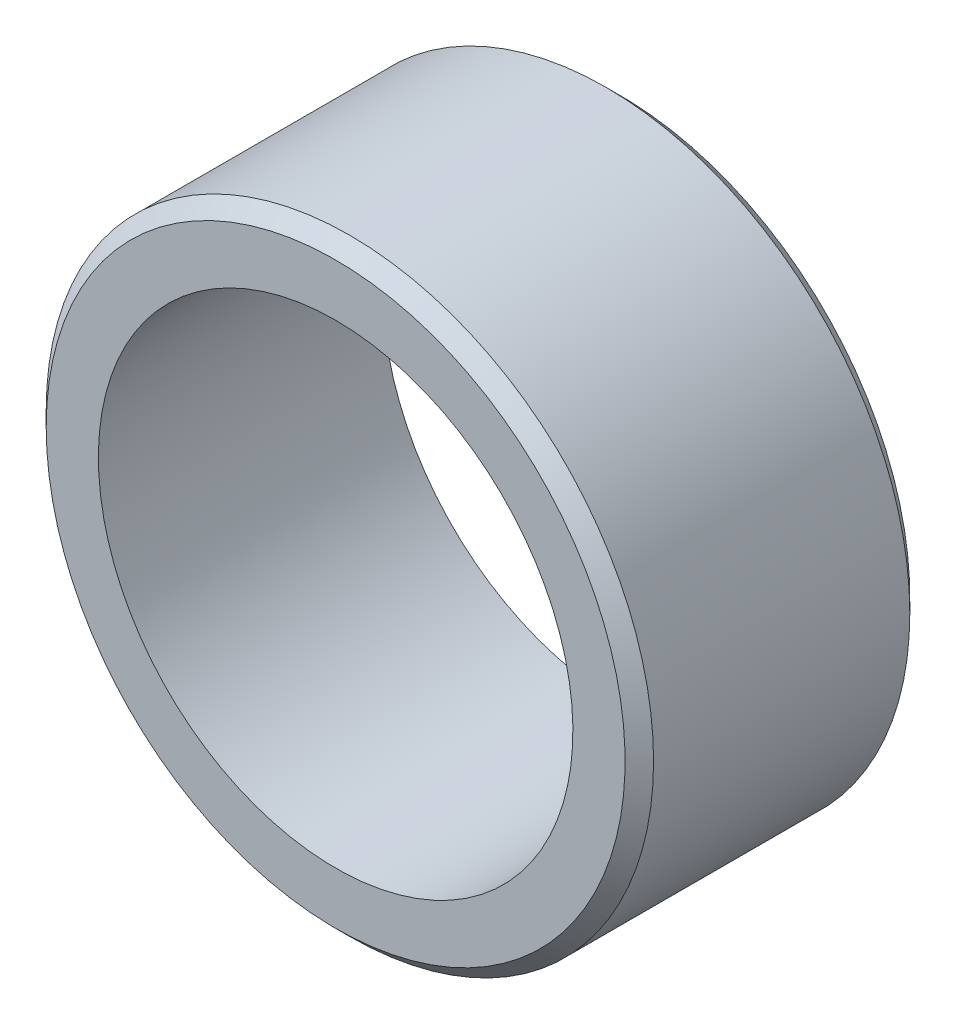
ISO-10303-21;
HEADER;
FILE_DESCRIPTION(('STEP AP214'),'2;1');
FILE_NAME('part.step','',(''),(''),'','','');
FILE_SCHEMA(('AUTOMOTIVE_DESIGN { 1 0 10303 214 1 1 1 1 }'));
ENDSEC;
DATA;
#1=APPLICATION_CONTEXT('core data for automotive mechanical design processes');
#2=APPLICATION_PROTOCOL_DEFINITION('international standard','automotive_design',2000,#1);
#3=PRODUCT_CONTEXT('',#1,'mechanical');
#4=PRODUCT('Part','Part','',(#3));
#5=PRODUCT_RELATED_PRODUCT_CATEGORY('part','',(#4));
#6=PRODUCT_DEFINITION_FORMATION('','',#4);
#7=PRODUCT_DEFINITION_CONTEXT('part definition',#1,'design');
#8=PRODUCT_DEFINITION('design','',#6,#7);
#9=PRODUCT_DEFINITION_SHAPE('','',#8);
#10=(LENGTH_UNIT() NAMED_UNIT(*) SI_UNIT(.MILLI.,.METRE.));
#11=(NAMED_UNIT(*) PLANE_ANGLE_UNIT() SI_UNIT($,.RADIAN.));
#12=(NAMED_UNIT(*) SI_UNIT($,.STERADIAN.) SOLID_ANGLE_UNIT());
#13=UNCERTAINTY_MEASURE_WITH_UNIT(LENGTH_MEASURE(1.E-05),#10,'distance_accuracy_value','');
#14=(GEOMETRIC_REPRESENTATION_CONTEXT(3) GLOBAL_UNCERTAINTY_ASSIGNED_CONTEXT((#13)) GLOBAL_UNIT_ASSIGNED_CONTEXT((#10,
#11,#12)) REPRESENTATION_CONTEXT('',''));
#15=CARTESIAN_POINT('',(0.,0.,0.));
#16=DIRECTION('',(0.,0.,1.));
#17=DIRECTION('',(1.,0.,0.));
#18=AXIS2_PLACEMENT_3D('',#15,#16,#17);
#19=CARTESIAN_POINT('',(0.,0.,7.5000000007));
#20=DIRECTION('',(0.,0.,-1.));
#21=DIRECTION('',(0.,1.,0.));
#22=AXIS2_PLACEMENT_3D('',#19,#20,#21);
#23=CYLINDRICAL_SURFACE('',#22,12.5000000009);
#24=CARTESIAN_POINT('',(0.,0.,0.));
#25=DIRECTION('',(0.,0.,-1.));
#26=DIRECTION('',(0.,1.,0.));
#27=AXIS2_PLACEMENT_3D('',#24,#25,#26);
#28=CIRCLE('',#27,12.5000000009);
#29=CARTESIAN_POINT('',(0.,12.5000000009,0.));
#30=VERTEX_POINT('',#29);
#31=EDGE_CURVE('E19',#30,#30,#28,.F.);
#32=ORIENTED_EDGE('',*,*,#31,.F.);
#33=EDGE_LOOP('',(#32));
#34=FACE_BOUND('',#33,.T.);
#35=CARTESIAN_POINT('',(0.,0.,15.));
#36=DIRECTION('',(0.,0.,-1.));
#37=DIRECTION('',(0.,1.,0.));
#38=AXIS2_PLACEMENT_3D('',#35,#36,#37);
#39=CIRCLE('',#38,12.5000000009);
#40=CARTESIAN_POINT('',(0.,12.5000000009,15.));
#41=VERTEX_POINT('',#40);
#42=EDGE_CURVE('E35',#41,#41,#39,.F.);
#43=ORIENTED_EDGE('',*,*,#42,.T.);
#44=EDGE_LOOP('',(#43));
#45=FACE_BOUND('',#44,.T.);
#46=ADVANCED_FACE('F15',(#34,#45),#23,.F.);
#47=CARTESIAN_POINT('',(0.,15.2500000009,9.31320798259E-10));
#48=DIRECTION('',(0.,0.,-1.));
#49=DIRECTION('',(0.,1.,0.));
#50=AXIS2_PLACEMENT_3D('',#47,#48,#49);
#51=PLANE('',#50);
#52=ORIENTED_EDGE('',*,*,#31,.T.);
#53=EDGE_LOOP('',(#52));
#54=FACE_BOUND('',#53,.T.);
#55=CARTESIAN_POINT('',(0.,0.,8.98623189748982E-10));
#56=DIRECTION('',(0.,0.,1.));
#57=DIRECTION('',(0.,-1.,0.));
#58=AXIS2_PLACEMENT_3D('',#55,#56,#57);
#59=CIRCLE('',#58,15.2500000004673);
#60=CARTESIAN_POINT('',(0.,-15.2500000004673,8.98624022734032E-10));
#61=VERTEX_POINT('',#60);
#62=EDGE_CURVE('E33',#61,#61,#59,.T.);
#63=ORIENTED_EDGE('',*,*,#62,.F.);
#64=EDGE_LOOP('',(#63));
#65=FACE_BOUND('',#64,.T.);
#66=ADVANCED_FACE('F42',(#54,#65),#51,.T.);
#67=CARTESIAN_POINT('',(0.,15.2500000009,15.0000000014));
#68=DIRECTION('',(0.,0.,-1.));
#69=DIRECTION('',(0.,1.,0.));
#70=AXIS2_PLACEMENT_3D('',#67,#68,#69);
#71=PLANE('',#70);
#72=ORIENTED_EDGE('',*,*,#42,.F.);
#73=EDGE_LOOP('',(#72));
#74=FACE_BOUND('',#73,.T.);
#75=CARTESIAN_POINT('',(0.,0.,15.0000000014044));
#76=DIRECTION('',(0.,0.,-1.));
#77=DIRECTION('',(-1.,0.,0.));
#78=AXIS2_PLACEMENT_3D('',#75,#76,#77);
#79=CIRCLE('',#78,15.2500000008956);
#80=CARTESIAN_POINT('',(-15.2500000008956,0.,15.0000000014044));
#81=VERTEX_POINT('',#80);
#82=EDGE_CURVE('E28',#81,#81,#79,.T.);
#83=ORIENTED_EDGE('',*,*,#82,.F.);
#84=EDGE_LOOP('',(#83));
#85=FACE_BOUND('',#84,.T.);
#86=ADVANCED_FACE('F51',(#74,#85),#71,.F.);
#87=CARTESIAN_POINT('',(0.,0.,0.750000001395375));
#88=DIRECTION('',(0.,0.,1.));
#89=DIRECTION('',(0.,-1.,0.));
#90=AXIS2_PLACEMENT_3D('',#87,#88,#89);
#91=CONICAL_SURFACE('',#90,16.0000000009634,0.785398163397);
#92=CARTESIAN_POINT('',(0.,0.,0.750000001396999));
#93=DIRECTION('',(0.,0.,-1.));
#94=DIRECTION('',(0.,1.,0.));
#95=AXIS2_PLACEMENT_3D('',#92,#93,#94);
#96=CIRCLE('',#95,16.0000000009);
#97=CARTESIAN_POINT('',(0.,16.0000000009,0.750000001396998));
#98=VERTEX_POINT('',#97);
#99=EDGE_CURVE('E23',#98,#98,#96,.F.);
#100=ORIENTED_EDGE('',*,*,#99,.F.);
#101=EDGE_LOOP('',(#100));
#102=FACE_BOUND('',#101,.T.);
#103=ORIENTED_EDGE('',*,*,#62,.T.);
#104=EDGE_LOOP('',(#103));
#105=FACE_BOUND('',#104,.T.);
#106=ADVANCED_FACE('F58',(#102,#105),#91,.T.);
#107=CARTESIAN_POINT('',(0.,0.,14.2500000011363));
#108=DIRECTION('',(0.,0.,-1.));
#109=DIRECTION('',(-1.,0.,0.));
#110=AXIS2_PLACEMENT_3D('',#107,#108,#109);
#111=CONICAL_SURFACE('',#110,16.000000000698,0.785398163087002);
#112=ORIENTED_EDGE('',*,*,#82,.T.);
#113=EDGE_LOOP('',(#112));
#114=FACE_BOUND('',#113,.T.);
#115=CARTESIAN_POINT('',(0.,0.,14.2500000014));
#116=DIRECTION('',(0.,0.,-1.));
#117=DIRECTION('',(0.,1.,0.));
#118=AXIS2_PLACEMENT_3D('',#115,#116,#117);
#119=CIRCLE('',#118,16.0000000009);
#120=CARTESIAN_POINT('',(0.,16.0000000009,14.2500000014));
#121=VERTEX_POINT('',#120);
#122=EDGE_CURVE('E10',#121,#121,#119,.T.);
#123=ORIENTED_EDGE('',*,*,#122,.F.);
#124=EDGE_LOOP('',(#123));
#125=FACE_BOUND('',#124,.T.);
#126=ADVANCED_FACE('F54',(#114,#125),#111,.T.);
#127=CARTESIAN_POINT('',(0.,0.,7.5000000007));
#128=DIRECTION('',(0.,0.,-1.));
#129=DIRECTION('',(0.,1.,0.));
#130=AXIS2_PLACEMENT_3D('',#127,#128,#129);
#131=CYLINDRICAL_SURFACE('',#130,16.0000000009);
#132=ORIENTED_EDGE('',*,*,#122,.T.);
#133=EDGE_LOOP('',(#132));
#134=FACE_BOUND('',#133,.T.);
#135=ORIENTED_EDGE('',*,*,#99,.T.);
#136=EDGE_LOOP('',(#135));
#137=FACE_BOUND('',#136,.T.);
#138=ADVANCED_FACE('F17',(#134,#137),#131,.T.);
#139=CLOSED_SHELL('',(#46,#66,#86,#106,#126,#138));
#140=MANIFOLD_SOLID_BREP('B1',#139);
#141=ADVANCED_BREP_SHAPE_REPRESENTATION('',(#18,#140),#14);
#142=SHAPE_DEFINITION_REPRESENTATION(#9,#141);
ENDSEC;
END-ISO-10303-21;
